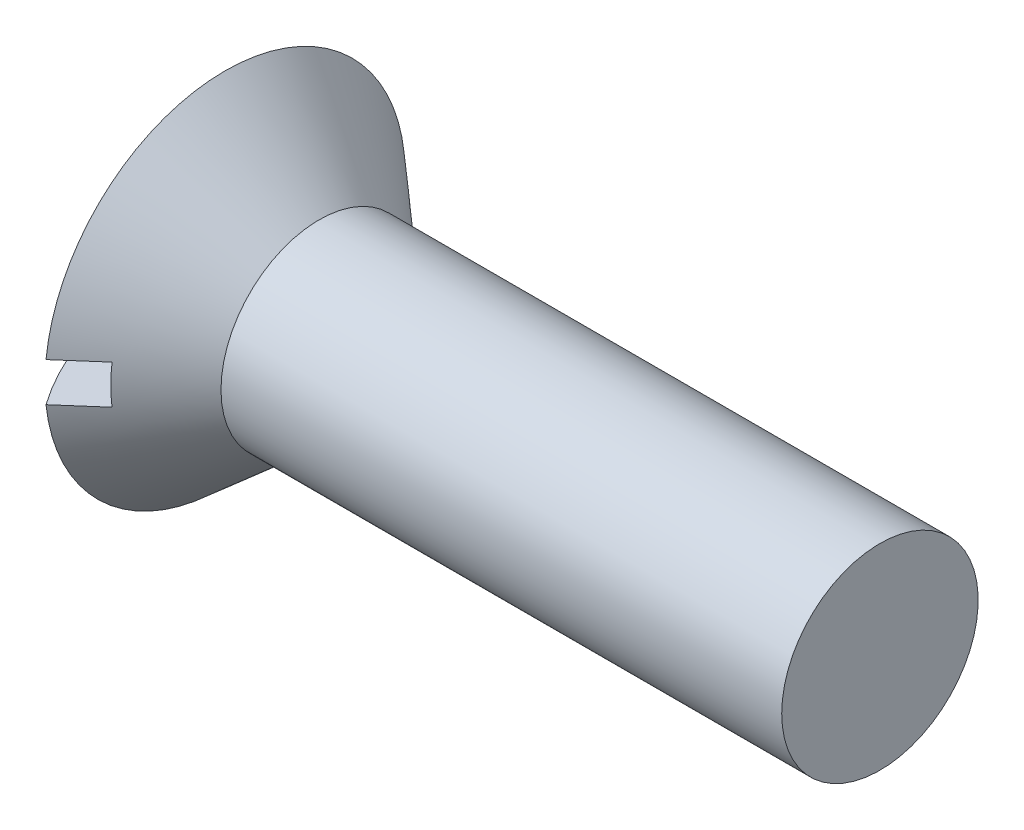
ISO-10303-21;
HEADER;
FILE_DESCRIPTION(('STEP AP214'),'2;1');
FILE_NAME('part.step','',(''),(''),'','','');
FILE_SCHEMA(('AUTOMOTIVE_DESIGN { 1 0 10303 214 1 1 1 1 }'));
ENDSEC;
DATA;
#1=APPLICATION_CONTEXT('core data for automotive mechanical design processes');
#2=APPLICATION_PROTOCOL_DEFINITION('international standard','automotive_design',2000,#1);
#3=PRODUCT_CONTEXT('',#1,'mechanical');
#4=PRODUCT('Part','Part','',(#3));
#5=PRODUCT_RELATED_PRODUCT_CATEGORY('part','',(#4));
#6=PRODUCT_DEFINITION_FORMATION('','',#4);
#7=PRODUCT_DEFINITION_CONTEXT('part definition',#1,'design');
#8=PRODUCT_DEFINITION('design','',#6,#7);
#9=PRODUCT_DEFINITION_SHAPE('','',#8);
#10=(LENGTH_UNIT() NAMED_UNIT(*) SI_UNIT(.MILLI.,.METRE.));
#11=(NAMED_UNIT(*) PLANE_ANGLE_UNIT() SI_UNIT($,.RADIAN.));
#12=(NAMED_UNIT(*) SI_UNIT($,.STERADIAN.) SOLID_ANGLE_UNIT());
#13=UNCERTAINTY_MEASURE_WITH_UNIT(LENGTH_MEASURE(1.E-05),#10,'distance_accuracy_value','');
#14=(GEOMETRIC_REPRESENTATION_CONTEXT(3) GLOBAL_UNCERTAINTY_ASSIGNED_CONTEXT((#13)) GLOBAL_UNIT_ASSIGNED_CONTEXT((#10,
#11,#12)) REPRESENTATION_CONTEXT('',''));
#15=CARTESIAN_POINT('',(0.,0.,0.));
#16=DIRECTION('',(0.,0.,1.));
#17=DIRECTION('',(1.,0.,0.));
#18=AXIS2_PLACEMENT_3D('',#15,#16,#17);
#19=CARTESIAN_POINT('',(8.9662,1.8923,-17.4625));
#20=DIRECTION('',(-1.,0.,0.));
#21=DIRECTION('',(0.,0.,1.));
#22=AXIS2_PLACEMENT_3D('',#19,#20,#21);
#23=PLANE('',#22);
#24=DIRECTION('',(0.,0.,1.));
#25=VECTOR('',#24,1.);
#26=CARTESIAN_POINT('',(8.9662,-1.8923,-17.4625));
#27=LINE('',#26,#25);
#28=CARTESIAN_POINT('',(8.9662,-1.8923,-14.3689069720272));
#29=VERTEX_POINT('',#28);
#30=CARTESIAN_POINT('',(8.9662,-1.8923,14.3689069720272));
#31=VERTEX_POINT('',#30);
#32=EDGE_CURVE('E244',#29,#31,#27,.T.);
#33=ORIENTED_EDGE('',*,*,#32,.T.);
#34=CARTESIAN_POINT('',(8.9662,0.,0.));
#35=DIRECTION('',(-1.,0.,0.));
#36=DIRECTION('',(0.,0.,1.));
#37=AXIS2_PLACEMENT_3D('',#34,#35,#36);
#38=CIRCLE('',#37,14.4929737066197);
#39=CARTESIAN_POINT('',(8.9662,1.8923,14.3689069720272));
#40=VERTEX_POINT('',#39);
#41=EDGE_CURVE('E264',#40,#31,#38,.F.);
#42=ORIENTED_EDGE('',*,*,#41,.F.);
#43=DIRECTION('',(0.,0.,-1.));
#44=VECTOR('',#43,1.);
#45=CARTESIAN_POINT('',(8.9662,1.8923,17.4625));
#46=LINE('',#45,#44);
#47=CARTESIAN_POINT('',(8.9662,1.8923,-14.3689069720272));
#48=VERTEX_POINT('',#47);
#49=EDGE_CURVE('E241',#40,#48,#46,.T.);
#50=ORIENTED_EDGE('',*,*,#49,.T.);
#51=EDGE_CURVE('E268',#29,#48,#38,.F.);
#52=ORIENTED_EDGE('',*,*,#51,.F.);
#53=EDGE_LOOP('',(#33,#42,#50,#52));
#54=FACE_BOUND('',#53,.T.);
#55=DIRECTION('',(0.,-1.,0.));
#56=VECTOR('',#55,1.);
#57=CARTESIAN_POINT('',(8.9662,1.8923,0.737997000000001));
#58=LINE('',#57,#56);
#59=CARTESIAN_POINT('',(8.9662,1.561719,0.737997));
#60=VERTEX_POINT('',#59);
#61=CARTESIAN_POINT('',(8.9662,0.737996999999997,0.737997));
#62=VERTEX_POINT('',#61);
#63=EDGE_CURVE('E183',#60,#62,#58,.T.);
#64=ORIENTED_EDGE('',*,*,#63,.T.);
#65=DIRECTION('',(0.,0.,1.));
#66=VECTOR('',#65,1.);
#67=CARTESIAN_POINT('',(8.9662,0.737997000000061,-17.4625));
#68=LINE('',#67,#66);
#69=CARTESIAN_POINT('',(8.9662,0.737996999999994,1.561719));
#70=VERTEX_POINT('',#69);
#71=EDGE_CURVE('E163',#62,#70,#68,.T.);
#72=ORIENTED_EDGE('',*,*,#71,.T.);
#73=DIRECTION('',(0.,1.,0.));
#74=VECTOR('',#73,1.);
#75=CARTESIAN_POINT('',(8.9662,1.89229999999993,1.56171900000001));
#76=LINE('',#75,#74);
#77=CARTESIAN_POINT('',(8.9662,-0.737997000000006,1.561719));
#78=VERTEX_POINT('',#77);
#79=EDGE_CURVE('E176',#78,#70,#76,.T.);
#80=ORIENTED_EDGE('',*,*,#79,.F.);
#81=DIRECTION('',(0.,0.,-1.));
#82=VECTOR('',#81,1.);
#83=CARTESIAN_POINT('',(8.9662,-0.737996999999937,-17.4625));
#84=LINE('',#83,#82);
#85=CARTESIAN_POINT('',(8.9662,-0.737997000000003,0.737997));
#86=VERTEX_POINT('',#85);
#87=EDGE_CURVE('E206',#78,#86,#84,.T.);
#88=ORIENTED_EDGE('',*,*,#87,.T.);
#89=CARTESIAN_POINT('',(8.9662,-1.561719,0.737997));
#90=VERTEX_POINT('',#89);
#91=EDGE_CURVE('E319',#86,#90,#58,.T.);
#92=ORIENTED_EDGE('',*,*,#91,.T.);
#93=DIRECTION('',(0.,0.,1.));
#94=VECTOR('',#93,1.);
#95=CARTESIAN_POINT('',(8.9662,-1.561719,-17.4625));
#96=LINE('',#95,#94);
#97=CARTESIAN_POINT('',(8.9662,-1.561719,-0.737997));
#98=VERTEX_POINT('',#97);
#99=EDGE_CURVE('E323',#98,#90,#96,.T.);
#100=ORIENTED_EDGE('',*,*,#99,.F.);
#101=DIRECTION('',(0.,1.,0.));
#102=VECTOR('',#101,1.);
#103=CARTESIAN_POINT('',(8.9662,1.8923,-0.737996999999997));
#104=LINE('',#103,#102);
#105=CARTESIAN_POINT('',(8.9662,-0.737996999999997,-0.737997));
#106=VERTEX_POINT('',#105);
#107=EDGE_CURVE('E321',#98,#106,#104,.T.);
#108=ORIENTED_EDGE('',*,*,#107,.T.);
#109=CARTESIAN_POINT('',(8.9662,-0.737996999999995,-1.561719));
#110=VERTEX_POINT('',#109);
#111=EDGE_CURVE('E350',#106,#110,#84,.T.);
#112=ORIENTED_EDGE('',*,*,#111,.T.);
#113=DIRECTION('',(0.,-1.,0.));
#114=VECTOR('',#113,1.);
#115=CARTESIAN_POINT('',(8.9662,1.89229999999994,-1.561719));
#116=LINE('',#115,#114);
#117=CARTESIAN_POINT('',(8.9662,0.737997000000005,-1.561719));
#118=VERTEX_POINT('',#117);
#119=EDGE_CURVE('E177',#118,#110,#116,.T.);
#120=ORIENTED_EDGE('',*,*,#119,.F.);
#121=CARTESIAN_POINT('',(8.9662,0.737997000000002,-0.737997));
#122=VERTEX_POINT('',#121);
#123=EDGE_CURVE('E167',#118,#122,#68,.T.);
#124=ORIENTED_EDGE('',*,*,#123,.T.);
#125=CARTESIAN_POINT('',(8.9662,1.561719,-0.737996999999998));
#126=VERTEX_POINT('',#125);
#127=EDGE_CURVE('E318',#122,#126,#104,.T.);
#128=ORIENTED_EDGE('',*,*,#127,.T.);
#129=DIRECTION('',(0.,0.,-1.));
#130=VECTOR('',#129,1.);
#131=CARTESIAN_POINT('',(8.9662,1.561719,-17.4625));
#132=LINE('',#131,#130);
#133=EDGE_CURVE('E41',#60,#126,#132,.T.);
#134=ORIENTED_EDGE('',*,*,#133,.F.);
#135=EDGE_LOOP('',(#64,#72,#80,#88,#92,#100,#108,#112,#120,#124,#128,#134));
#136=FACE_BOUND('',#135,.T.);
#137=ADVANCED_FACE('F33',(#54,#136),#23,.T.);
#138=CARTESIAN_POINT('',(11.034701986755,0.,0.603544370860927));
#139=DIRECTION('',(-0.06486312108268,0.,-0.997894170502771));
#140=DIRECTION('',(-0.997894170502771,0.,0.06486312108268));
#141=AXIS2_PLACEMENT_3D('',#138,#139,#140);
#142=PLANE('',#141);
#143=DIRECTION('',(0.797008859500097,-0.601741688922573,-0.0518055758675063));
#144=VECTOR('',#143,1.);
#145=CARTESIAN_POINT('',(0.,8.3312,1.3208));
#146=LINE('',#145,#144);
#147=CARTESIAN_POINT('',(10.16,0.660399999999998,0.660400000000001));
#148=VERTEX_POINT('',#147);
#149=EDGE_CURVE('E181',#60,#148,#146,.T.);
#150=ORIENTED_EDGE('',*,*,#149,.T.);
#151=DIRECTION('',(-0.995801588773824,0.0647271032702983,0.0647271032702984));
#152=VECTOR('',#151,1.);
#153=CARTESIAN_POINT('',(11.0736036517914,0.601015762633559,0.601015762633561));
#154=LINE('',#153,#152);
#155=EDGE_CURVE('E158',#148,#62,#154,.T.);
#156=ORIENTED_EDGE('',*,*,#155,.T.);
#157=ORIENTED_EDGE('',*,*,#63,.F.);
#158=EDGE_LOOP('',(#150,#156,#157));
#159=FACE_BOUND('',#158,.T.);
#160=ADVANCED_FACE('F182',(#159),#142,.T.);
#161=ORIENTED_EDGE('',*,*,#91,.F.);
#162=DIRECTION('',(0.995801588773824,0.0647271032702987,-0.0647271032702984));
#163=VECTOR('',#162,1.);
#164=CARTESIAN_POINT('',(11.0736036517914,-0.601015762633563,0.601015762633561));
#165=LINE('',#164,#163);
#166=CARTESIAN_POINT('',(10.16,-0.6604,0.6604));
#167=VERTEX_POINT('',#166);
#168=EDGE_CURVE('E333',#86,#167,#165,.T.);
#169=ORIENTED_EDGE('',*,*,#168,.T.);
#170=DIRECTION('',(0.797008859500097,0.601741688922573,-0.0518055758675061));
#171=VECTOR('',#170,1.);
#172=CARTESIAN_POINT('',(0.,-8.3312,1.3208));
#173=LINE('',#172,#171);
#174=EDGE_CURVE('E339',#90,#167,#173,.T.);
#175=ORIENTED_EDGE('',*,*,#174,.F.);
#176=EDGE_LOOP('',(#161,#169,#175));
#177=FACE_BOUND('',#176,.T.);
#178=ADVANCED_FACE('F313',(#177),#142,.T.);
#179=CARTESIAN_POINT('',(11.034701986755,0.,-0.603544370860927));
#180=DIRECTION('',(-0.0648631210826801,0.,0.997894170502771));
#181=DIRECTION('',(0.997894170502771,0.,0.0648631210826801));
#182=AXIS2_PLACEMENT_3D('',#179,#180,#181);
#183=PLANE('',#182);
#184=ORIENTED_EDGE('',*,*,#127,.F.);
#185=DIRECTION('',(0.995801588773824,-0.0647271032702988,0.0647271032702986));
#186=VECTOR('',#185,1.);
#187=CARTESIAN_POINT('',(11.0736036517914,0.601015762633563,-0.601015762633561));
#188=LINE('',#187,#186);
#189=CARTESIAN_POINT('',(10.16,0.660400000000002,-0.660399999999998));
#190=VERTEX_POINT('',#189);
#191=EDGE_CURVE('E329',#122,#190,#188,.T.);
#192=ORIENTED_EDGE('',*,*,#191,.T.);
#193=DIRECTION('',(0.797008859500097,-0.601741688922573,0.0518055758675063));
#194=VECTOR('',#193,1.);
#195=CARTESIAN_POINT('',(0.,8.3312,-1.3208));
#196=LINE('',#195,#194);
#197=EDGE_CURVE('E202',#126,#190,#196,.T.);
#198=ORIENTED_EDGE('',*,*,#197,.F.);
#199=EDGE_LOOP('',(#184,#192,#198));
#200=FACE_BOUND('',#199,.T.);
#201=ADVANCED_FACE('F328',(#200),#183,.T.);
#202=DIRECTION('',(0.797008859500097,0.601741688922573,0.0518055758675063));
#203=VECTOR('',#202,1.);
#204=CARTESIAN_POINT('',(0.,-8.3312,-1.3208));
#205=LINE('',#204,#203);
#206=CARTESIAN_POINT('',(10.16,-0.6604,-0.6604));
#207=VERTEX_POINT('',#206);
#208=EDGE_CURVE('E336',#98,#207,#205,.T.);
#209=ORIENTED_EDGE('',*,*,#208,.T.);
#210=DIRECTION('',(-0.995801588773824,-0.0647271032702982,-0.0647271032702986));
#211=VECTOR('',#210,1.);
#212=CARTESIAN_POINT('',(11.0736036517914,-0.601015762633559,-0.601015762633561));
#213=LINE('',#212,#211);
#214=EDGE_CURVE('E11',#207,#106,#213,.T.);
#215=ORIENTED_EDGE('',*,*,#214,.T.);
#216=ORIENTED_EDGE('',*,*,#107,.F.);
#217=EDGE_LOOP('',(#209,#215,#216));
#218=FACE_BOUND('',#217,.T.);
#219=ADVANCED_FACE('F396',(#218),#183,.T.);
#220=CARTESIAN_POINT('',(30.2463026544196,0.,0.));
#221=DIRECTION('',(-1.,0.,0.));
#222=DIRECTION('',(0.,1.,0.));
#223=AXIS2_PLACEMENT_3D('',#220,#221,#222);
#224=SPHERICAL_SURFACE('',#223,30.2463026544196);
#225=CARTESIAN_POINT('',(30.2463026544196,1.8923,0.));
#226=DIRECTION('',(0.,1.,0.));
#227=DIRECTION('',(0.,0.,1.));
#228=AXIS2_PLACEMENT_3D('',#225,#226,#227);
#229=CIRCLE('',#228,30.1870506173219);
#230=CARTESIAN_POINT('',(0.0879112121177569,1.8923,-1.31508577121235));
#231=VERTEX_POINT('',#230);
#232=CARTESIAN_POINT('',(5.55015076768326,1.8923,-17.3596689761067));
#233=VERTEX_POINT('',#232);
#234=EDGE_CURVE('E250',#231,#233,#229,.F.);
#235=ORIENTED_EDGE('',*,*,#234,.F.);
#236=CARTESIAN_POINT('',(30.20454047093,0.,0.642495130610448));
#237=DIRECTION('',(-0.0648631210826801,0.,0.997894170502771));
#238=DIRECTION('',(0.997894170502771,0.,0.0648631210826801));
#239=AXIS2_PLACEMENT_3D('',#236,#237,#238);
#240=CIRCLE('',#239,30.2394490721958);
#241=CARTESIAN_POINT('',(0.992628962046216,7.58176513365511,-1.256279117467));
#242=VERTEX_POINT('',#241);
#243=EDGE_CURVE('E233',#231,#242,#240,.F.);
#244=ORIENTED_EDGE('',*,*,#243,.T.);
#245=CARTESIAN_POINT('',(23.2711954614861,-9.23855257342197,0.));
#246=DIRECTION('',(0.602550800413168,0.798080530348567,0.));
#247=DIRECTION('',(-0.798080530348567,0.602550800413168,0.));
#248=AXIS2_PLACEMENT_3D('',#245,#246,#247);
#249=CIRCLE('',#248,27.9434402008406);
#250=CARTESIAN_POINT('',(0.992628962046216,7.58176513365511,1.256279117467));
#251=VERTEX_POINT('',#250);
#252=EDGE_CURVE('E239',#251,#242,#249,.F.);
#253=ORIENTED_EDGE('',*,*,#252,.F.);
#254=CARTESIAN_POINT('',(30.20454047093,0.,-0.642495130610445));
#255=DIRECTION('',(-0.06486312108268,0.,-0.997894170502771));
#256=DIRECTION('',(-0.997894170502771,0.,0.06486312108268));
#257=AXIS2_PLACEMENT_3D('',#254,#255,#256);
#258=CIRCLE('',#257,30.2394490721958);
#259=CARTESIAN_POINT('',(0.0879112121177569,1.8923,1.31508577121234));
#260=VERTEX_POINT('',#259);
#261=EDGE_CURVE('E223',#251,#260,#258,.F.);
#262=ORIENTED_EDGE('',*,*,#261,.T.);
#263=CARTESIAN_POINT('',(5.55015076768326,1.8923,17.3596689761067));
#264=VERTEX_POINT('',#263);
#265=EDGE_CURVE('E251',#264,#260,#229,.F.);
#266=ORIENTED_EDGE('',*,*,#265,.F.);
#267=CARTESIAN_POINT('',(5.55015076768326,0.,0.));
#268=DIRECTION('',(-1.,0.,0.));
#269=DIRECTION('',(0.,0.,1.));
#270=AXIS2_PLACEMENT_3D('',#267,#268,#269);
#271=CIRCLE('',#270,17.4625);
#272=EDGE_CURVE('E263',#264,#233,#271,.T.);
#273=ORIENTED_EDGE('',*,*,#272,.T.);
#274=EDGE_LOOP('',(#235,#244,#253,#262,#266,#273));
#275=FACE_BOUND('',#274,.T.);
#276=ADVANCED_FACE('F387',(#275),#224,.T.);
#277=CARTESIAN_POINT('',(23.2711954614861,9.23855257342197,0.));
#278=DIRECTION('',(0.602550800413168,-0.798080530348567,0.));
#279=DIRECTION('',(0.798080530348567,0.602550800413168,0.));
#280=AXIS2_PLACEMENT_3D('',#277,#278,#279);
#281=CIRCLE('',#280,27.9434402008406);
#282=CARTESIAN_POINT('',(0.992628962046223,-7.58176513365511,-1.256279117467));
#283=VERTEX_POINT('',#282);
#284=CARTESIAN_POINT('',(0.992628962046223,-7.58176513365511,1.25627911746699));
#285=VERTEX_POINT('',#284);
#286=EDGE_CURVE('E213',#283,#285,#281,.F.);
#287=ORIENTED_EDGE('',*,*,#286,.F.);
#288=CARTESIAN_POINT('',(30.20454047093,0.,0.642495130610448));
#289=DIRECTION('',(-0.0648631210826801,0.,0.997894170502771));
#290=DIRECTION('',(0.997894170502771,0.,0.0648631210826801));
#291=AXIS2_PLACEMENT_3D('',#288,#289,#290);
#292=CIRCLE('',#291,30.2394490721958);
#293=CARTESIAN_POINT('',(0.0879112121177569,-1.8923,-1.31508577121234));
#294=VERTEX_POINT('',#293);
#295=EDGE_CURVE('E228',#283,#294,#292,.F.);
#296=ORIENTED_EDGE('',*,*,#295,.T.);
#297=CARTESIAN_POINT('',(30.2463026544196,-1.8923,0.));
#298=DIRECTION('',(0.,-1.,0.));
#299=DIRECTION('',(0.,0.,-1.));
#300=AXIS2_PLACEMENT_3D('',#297,#298,#299);
#301=CIRCLE('',#300,30.1870506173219);
#302=CARTESIAN_POINT('',(5.55015076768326,-1.8923,-17.3596689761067));
#303=VERTEX_POINT('',#302);
#304=EDGE_CURVE('E247',#303,#294,#301,.F.);
#305=ORIENTED_EDGE('',*,*,#304,.F.);
#306=CARTESIAN_POINT('',(5.55015076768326,-1.8923,17.3596689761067));
#307=VERTEX_POINT('',#306);
#308=EDGE_CURVE('E260',#303,#307,#271,.T.);
#309=ORIENTED_EDGE('',*,*,#308,.T.);
#310=CARTESIAN_POINT('',(0.0879112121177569,-1.8923,1.31508577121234));
#311=VERTEX_POINT('',#310);
#312=EDGE_CURVE('E246',#311,#307,#301,.F.);
#313=ORIENTED_EDGE('',*,*,#312,.F.);
#314=CARTESIAN_POINT('',(30.20454047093,0.,-0.642495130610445));
#315=DIRECTION('',(-0.06486312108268,0.,-0.997894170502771));
#316=DIRECTION('',(-0.997894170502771,0.,0.06486312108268));
#317=AXIS2_PLACEMENT_3D('',#314,#315,#316);
#318=CIRCLE('',#317,30.2394490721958);
#319=EDGE_CURVE('E218',#311,#285,#318,.F.);
#320=ORIENTED_EDGE('',*,*,#319,.T.);
#321=EDGE_LOOP('',(#287,#296,#305,#309,#313,#320));
#322=FACE_BOUND('',#321,.T.);
#323=ADVANCED_FACE('F295',(#322),#224,.T.);
#324=CARTESIAN_POINT('',(8.9662,1.8923,17.4625));
#325=DIRECTION('',(0.,1.,0.));
#326=DIRECTION('',(0.,0.,1.));
#327=AXIS2_PLACEMENT_3D('',#324,#325,#326);
#328=PLANE('',#327);
#329=DIRECTION('',(0.997894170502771,0.,0.0648631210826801));
#330=VECTOR('',#329,1.);
#331=CARTESIAN_POINT('',(10.1442550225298,1.8923,-0.661423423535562));
#332=LINE('',#331,#330);
#333=CARTESIAN_POINT('',(8.52834437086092,1.8923,-0.76645761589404));
#334=VERTEX_POINT('',#333);
#335=EDGE_CURVE('E231',#231,#334,#332,.T.);
#336=ORIENTED_EDGE('',*,*,#335,.F.);
#337=ORIENTED_EDGE('',*,*,#234,.T.);
#338=CARTESIAN_POINT('',(-15.5050487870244,1.8923,-35.715411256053));
#339=CARTESIAN_POINT('',(-14.1406938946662,1.8923,-34.5277204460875));
#340=CARTESIAN_POINT('',(-12.7764101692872,1.8923,-33.3399478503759));
#341=CARTESIAN_POINT('',(-10.0480662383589,1.8923,-30.9641371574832));
#342=CARTESIAN_POINT('',(-8.6840060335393,1.8923,-29.7760990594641));
#343=CARTESIAN_POINT('',(-5.95598275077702,1.8923,-27.3994745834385));
#344=CARTESIAN_POINT('',(-4.5920197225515,1.8923,-26.2108881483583));
#345=CARTESIAN_POINT('',(-1.86456729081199,1.8923,-23.8331804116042));
#346=CARTESIAN_POINT('',(-0.501077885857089,1.8923,-22.6440591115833));
#347=CARTESIAN_POINT('',(2.21114624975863,1.8923,-20.2772147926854));
#348=CARTESIAN_POINT('',(3.55988847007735,1.8923,-19.0995003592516));
#349=CARTESIAN_POINT('',(5.58207778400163,1.8923,-17.3318587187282));
#350=CARTESIAN_POINT('',(6.25599005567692,1.8923,-16.742463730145));
#351=CARTESIAN_POINT('',(7.60338463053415,1.8923,-15.5631834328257));
#352=CARTESIAN_POINT('',(8.27686693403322,1.8923,-14.9732981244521));
#353=CARTESIAN_POINT('',(9.62314657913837,1.8923,-13.7929118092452));
#354=CARTESIAN_POINT('',(10.2959439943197,1.8923,-13.2024108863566));
#355=CARTESIAN_POINT('',(11.6406484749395,1.8923,-12.0203920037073));
#356=CARTESIAN_POINT('',(12.3125555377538,1.8923,-11.4288740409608));
#357=CARTESIAN_POINT('',(13.6549790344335,1.8923,-10.2442823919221));
#358=CARTESIAN_POINT('',(14.3254954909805,1.8923,-9.65120873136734));
#359=CARTESIAN_POINT('',(15.329486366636,1.8923,-8.75959235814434));
#360=CARTESIAN_POINT('',(15.6638518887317,1.8923,-8.46205330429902));
#361=CARTESIAN_POINT('',(16.3317648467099,1.8923,-7.86605866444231));
#362=CARTESIAN_POINT('',(16.6653122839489,1.8923,-7.5676030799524));
#363=CARTESIAN_POINT('',(17.1729591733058,1.8923,-7.11159936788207));
#364=CARTESIAN_POINT('',(17.3474765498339,1.8923,-6.95451652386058));
#365=CARTESIAN_POINT('',(17.6961222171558,1.8923,-6.63991888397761));
#366=CARTESIAN_POINT('',(17.8702505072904,1.8923,-6.48240408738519));
#367=CARTESIAN_POINT('',(18.2180548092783,1.8923,-6.16681999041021));
#368=CARTESIAN_POINT('',(18.3917307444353,1.8923,-6.00875060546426));
#369=CARTESIAN_POINT('',(18.7384791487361,1.8923,-5.69195182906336));
#370=CARTESIAN_POINT('',(18.911551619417,1.8923,-5.53322243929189));
#371=CARTESIAN_POINT('',(19.2574412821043,1.8923,-5.21445042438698));
#372=CARTESIAN_POINT('',(19.4302561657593,1.8923,-5.05440529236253));
#373=CARTESIAN_POINT('',(19.7748686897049,1.8923,-4.73322398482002));
#374=CARTESIAN_POINT('',(19.9466663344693,1.8923,-4.57208781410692));
#375=CARTESIAN_POINT('',(20.2888297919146,1.8923,-4.24842870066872));
#376=CARTESIAN_POINT('',(20.4591961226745,1.8923,-4.08590630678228));
#377=CARTESIAN_POINT('',(20.7980187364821,1.8923,-3.75888936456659));
#378=CARTESIAN_POINT('',(20.966475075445,1.8923,-3.59439487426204));
#379=CARTESIAN_POINT('',(21.3001804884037,1.8923,-3.26307453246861));
#380=CARTESIAN_POINT('',(21.4654370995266,1.8923,-3.09625632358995));
#381=CARTESIAN_POINT('',(21.7102247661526,1.8923,-2.84286427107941));
#382=CARTESIAN_POINT('',(21.7913457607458,1.8923,-2.75782782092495));
#383=CARTESIAN_POINT('',(21.9522191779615,1.8923,-2.58647210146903));
#384=CARTESIAN_POINT('',(22.0319716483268,1.8923,-2.50015287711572));
#385=CARTESIAN_POINT('',(22.1896478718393,1.8923,-2.32596801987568));
#386=CARTESIAN_POINT('',(22.2675729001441,1.8923,-2.23810354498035));
#387=CARTESIAN_POINT('',(22.4210573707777,1.8923,-2.06033879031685));
#388=CARTESIAN_POINT('',(22.4966170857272,1.8923,-1.97043874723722));
#389=CARTESIAN_POINT('',(22.6443921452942,1.8923,-1.78813953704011));
#390=CARTESIAN_POINT('',(22.716612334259,1.8923,-1.6957443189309));
#391=CARTESIAN_POINT('',(22.8564713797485,1.8923,-1.50756971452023));
#392=CARTESIAN_POINT('',(22.9241125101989,1.8923,-1.41179204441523));
#393=CARTESIAN_POINT('',(23.0326352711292,1.8923,-1.24636364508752));
#394=CARTESIAN_POINT('',(23.0752840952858,1.8923,-1.17787883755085));
#395=CARTESIAN_POINT('',(23.1563723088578,1.8923,-1.03839313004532));
#396=CARTESIAN_POINT('',(23.1948100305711,1.8923,-0.96739124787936));
#397=CARTESIAN_POINT('',(23.265817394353,1.8923,-0.823020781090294));
#398=CARTESIAN_POINT('',(23.2984219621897,1.8923,-0.749669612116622));
#399=CARTESIAN_POINT('',(23.3562088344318,1.8923,-0.600098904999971));
#400=CARTESIAN_POINT('',(23.3813986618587,1.8923,-0.523882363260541));
#401=CARTESIAN_POINT('',(23.4146011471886,1.8923,-0.398188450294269));
#402=CARTESIAN_POINT('',(23.4255088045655,1.8923,-0.349472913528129));
#403=CARTESIAN_POINT('',(23.4432112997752,1.8923,-0.251306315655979));
#404=CARTESIAN_POINT('',(23.4500077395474,1.8923,-0.201855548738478));
#405=CARTESIAN_POINT('',(23.4591640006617,1.8923,-0.102571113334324));
#406=CARTESIAN_POINT('',(23.4615265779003,1.8923,-0.0527377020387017));
#407=CARTESIAN_POINT('',(23.4617021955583,1.8923,0.0469391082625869));
#408=CARTESIAN_POINT('',(23.4595150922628,1.8923,0.0967825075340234));
#409=CARTESIAN_POINT('',(23.4507174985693,1.8923,0.195918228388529));
#410=CARTESIAN_POINT('',(23.4441205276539,1.8923,0.245211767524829));
#411=CARTESIAN_POINT('',(23.4268294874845,1.8923,0.343076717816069));
#412=CARTESIAN_POINT('',(23.4161344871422,1.8923,0.391647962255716));
#413=CARTESIAN_POINT('',(23.3910724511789,1.8923,0.487901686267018));
#414=CARTESIAN_POINT('',(23.3766998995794,1.8923,0.535582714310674));
#415=CARTESIAN_POINT('',(23.3447813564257,1.8923,0.629857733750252));
#416=CARTESIAN_POINT('',(23.3272353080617,1.8923,0.676451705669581));
#417=CARTESIAN_POINT('',(23.2621196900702,1.8923,0.835171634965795));
#418=CARTESIAN_POINT('',(23.2078474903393,1.8923,0.944552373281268));
#419=CARTESIAN_POINT('',(23.0888989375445,1.8923,1.15753031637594));
#420=CARTESIAN_POINT('',(23.0242010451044,1.8923,1.26111493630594));
#421=CARTESIAN_POINT('',(22.8874797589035,1.8923,1.46451215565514));
#422=CARTESIAN_POINT('',(22.8154009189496,1.8923,1.56428709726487));
#423=CARTESIAN_POINT('',(22.7038424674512,1.8923,1.71121549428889));
#424=CARTESIAN_POINT('',(22.6661011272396,1.8923,1.75971424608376));
#425=CARTESIAN_POINT('',(22.5896404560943,1.8923,1.85593349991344));
#426=CARTESIAN_POINT('',(22.5509211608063,1.8923,1.90365403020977));
#427=CARTESIAN_POINT('',(22.4259654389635,1.8923,2.05498191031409));
#428=CARTESIAN_POINT('',(22.3381770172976,1.8923,2.15730689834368));
#429=CARTESIAN_POINT('',(22.1598499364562,1.8923,2.35953904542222));
#430=CARTESIAN_POINT('',(22.0693108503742,1.8923,2.45944582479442));
#431=CARTESIAN_POINT('',(21.8861840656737,1.8923,2.65744732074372));
#432=CARTESIAN_POINT('',(21.7935954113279,1.8923,2.75554115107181));
#433=CARTESIAN_POINT('',(21.6069036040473,1.8923,2.95027925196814));
#434=CARTESIAN_POINT('',(21.5128003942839,1.8923,3.04692346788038));
#435=CARTESIAN_POINT('',(21.2284203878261,1.8923,3.33549678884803));
#436=CARTESIAN_POINT('',(21.0364062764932,1.8923,3.52571194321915));
#437=CARTESIAN_POINT('',(20.649545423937,1.8923,3.90310850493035));
#438=CARTESIAN_POINT('',(20.4546995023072,1.8923,4.09029075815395));
#439=CARTESIAN_POINT('',(20.0636531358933,1.8923,4.46201377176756));
#440=CARTESIAN_POINT('',(19.8674587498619,1.8923,4.6465609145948));
#441=CARTESIAN_POINT('',(19.4736812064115,1.8923,5.01419280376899));
#442=CARTESIAN_POINT('',(19.2760979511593,1.8923,5.19727744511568));
#443=CARTESIAN_POINT('',(18.8801396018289,1.8923,5.56215012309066));
#444=CARTESIAN_POINT('',(18.6817656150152,1.8923,5.74393936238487));
#445=CARTESIAN_POINT('',(18.2842596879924,1.8923,6.1066768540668));
#446=CARTESIAN_POINT('',(18.085127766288,1.8923,6.28762512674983));
#447=CARTESIAN_POINT('',(17.4887094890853,1.8923,6.8278242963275));
#448=CARTESIAN_POINT('',(17.0905582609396,1.8923,7.18612000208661));
#449=CARTESIAN_POINT('',(16.2927935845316,1.8923,7.90108069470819));
#450=CARTESIAN_POINT('',(15.8931801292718,1.8923,8.25774567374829));
#451=CARTESIAN_POINT('',(15.0929489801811,1.8923,8.96996376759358));
#452=CARTESIAN_POINT('',(14.6923312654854,1.8923,9.32551685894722));
#453=CARTESIAN_POINT('',(13.8903884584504,1.8923,10.0358246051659));
#454=CARTESIAN_POINT('',(13.4890633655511,1.8923,10.3905792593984));
#455=CARTESIAN_POINT('',(12.2839668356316,1.8923,11.4542863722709));
#456=CARTESIAN_POINT('',(11.4794272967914,1.8923,12.1623684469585));
#457=CARTESIAN_POINT('',(9.86917220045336,1.8923,13.5771764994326));
#458=CARTESIAN_POINT('',(9.06345665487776,1.8923,14.2839024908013));
#459=CARTESIAN_POINT('',(7.45128183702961,1.8923,15.6964671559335));
#460=CARTESIAN_POINT('',(6.64482258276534,1.8923,16.4023058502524));
#461=CARTESIAN_POINT('',(5.03138583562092,1.8923,17.8133948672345));
#462=CARTESIAN_POINT('',(4.22440834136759,1.8923,18.5186451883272));
#463=CARTESIAN_POINT('',(1.80314585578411,1.8923,20.6335994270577));
#464=CARTESIAN_POINT('',(0.188323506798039,1.8923,22.0426881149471));
#465=CARTESIAN_POINT('',(-2.59955329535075,1.8923,24.4740157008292));
#466=CARTESIAN_POINT('',(-3.77242263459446,1.8923,25.496466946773));
#467=CARTESIAN_POINT('',(-6.11850104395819,1.8923,27.5410693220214));
#468=CARTESIAN_POINT('',(-7.29171012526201,1.8923,28.5632204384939));
#469=CARTESIAN_POINT('',(-9.63820701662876,1.8923,30.607166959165));
#470=CARTESIAN_POINT('',(-10.8114948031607,1.8923,31.6289623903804));
#471=CARTESIAN_POINT('',(-13.1581861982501,1.8923,33.6723301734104));
#472=CARTESIAN_POINT('',(-14.3315898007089,1.8923,34.6939025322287));
#473=CARTESIAN_POINT('',(-15.5050487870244,1.8923,35.715411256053));
#474=B_SPLINE_CURVE_WITH_KNOTS('',3,(#338,#339,#340,#341,#342,#343,#344,#345,#346,#347,#348,
#349,#350,#351,#352,#353,#354,#355,#356,#357,#358,#359,#360,#361,#362,#363,#364,#365,#366,#367,
#368,#369,#370,#371,#372,#373,#374,#375,#376,#377,#378,#379,#380,#381,#382,#383,#384,#385,#386,
#387,#388,#389,#390,#391,#392,#393,#394,#395,#396,#397,#398,#399,#400,#401,#402,#403,#404,#405,
#406,#407,#408,#409,#410,#411,#412,#413,#414,#415,#416,#417,#418,#419,#420,#421,#422,#423,#424,
#425,#426,#427,#428,#429,#430,#431,#432,#433,#434,#435,#436,#437,#438,#439,#440,#441,#442,#443,
#444,#445,#446,#447,#448,#449,#450,#451,#452,#453,#454,#455,#456,#457,#458,#459,#460,#461,#462,
#463,#464,#465,#466,#467,#468,#469,#470,#471,#472,#473),.UNSPECIFIED.,.F.,.F.,(4,2,2,2,2,2,2,2,
2,2,2,2,2,2,2,2,2,2,2,2,2,2,2,2,2,2,2,2,2,2,2,2,2,2,2,2,2,2,2,2,2,2,2,2,2,2,2,2,2,2,2,2,2,2,2,2,
2,2,2,2,2,2,2,2,2,2,2,4),(0.,5.42666231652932,10.8533420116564,16.2808823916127,
21.7084061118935,27.0800952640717,29.7659651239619,32.4518330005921,35.1373730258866,
37.8229209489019,40.5084247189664,41.8511701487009,43.1939133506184,43.8983146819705,
44.6027172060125,45.3072322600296,46.0117455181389,46.718364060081,47.4249794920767,
48.1313270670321,48.8376539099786,49.5420411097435,49.8946010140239,50.2471485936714,
50.599442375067,50.9516954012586,51.3034202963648,51.6549692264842,51.8968961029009,
52.138918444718,52.3794392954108,52.6197152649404,52.7693296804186,52.9188857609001,
53.0683488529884,53.2178166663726,53.3668283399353,53.5158738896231,53.665144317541,
53.8144174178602,54.1797126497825,54.5457724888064,54.9148180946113,55.0991711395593,
55.2835174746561,55.6879070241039,56.0923596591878,56.4970050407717,56.9016656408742,
57.7124459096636,58.5229960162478,59.3310374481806,60.1391363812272,60.946348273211,
61.7535405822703,63.3604242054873,64.9673155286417,66.5742405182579,68.1811667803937,
71.3964360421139,74.6116729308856,77.8268339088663,81.0420034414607,87.4715158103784,
92.1394126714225,96.8074863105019,101.475037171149,106.142410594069),.UNSPECIFIED.);
#475=EDGE_CURVE('E365',#233,#48,#474,.T.);
#476=ORIENTED_EDGE('',*,*,#475,.T.);
#477=ORIENTED_EDGE('',*,*,#49,.F.);
#478=EDGE_CURVE('E276',#40,#264,#474,.T.);
#479=ORIENTED_EDGE('',*,*,#478,.T.);
#480=ORIENTED_EDGE('',*,*,#265,.T.);
#481=DIRECTION('',(-0.997894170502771,0.,0.06486312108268));
#482=VECTOR('',#481,1.);
#483=CARTESIAN_POINT('',(7.88368094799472,1.8923,0.808360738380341));
#484=LINE('',#483,#482);
#485=CARTESIAN_POINT('',(8.52834437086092,1.8923,0.766457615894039));
#486=VERTEX_POINT('',#485);
#487=EDGE_CURVE('E221',#486,#260,#484,.T.);
#488=ORIENTED_EDGE('',*,*,#487,.F.);
#489=DIRECTION('',(0.,0.,-1.));
#490=VECTOR('',#489,1.);
#491=CARTESIAN_POINT('',(8.52834437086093,1.8923,17.4625));
#492=LINE('',#491,#490);
#493=EDGE_CURVE('E236',#486,#334,#492,.T.);
#494=ORIENTED_EDGE('',*,*,#493,.T.);
#495=EDGE_LOOP('',(#336,#337,#476,#477,#479,#480,#488,#494));
#496=FACE_BOUND('',#495,.T.);
#497=ADVANCED_FACE('F290',(#496),#328,.F.);
#498=CARTESIAN_POINT('',(8.9662,-1.8923,-17.4625));
#499=DIRECTION('',(0.,-1.,0.));
#500=DIRECTION('',(0.,0.,-1.));
#501=AXIS2_PLACEMENT_3D('',#498,#499,#500);
#502=PLANE('',#501);
#503=DIRECTION('',(-0.997894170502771,0.,-0.0648631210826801));
#504=VECTOR('',#503,1.);
#505=CARTESIAN_POINT('',(7.88368094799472,-1.8923,-0.808360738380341));
#506=LINE('',#505,#504);
#507=CARTESIAN_POINT('',(8.52834437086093,-1.8923,-0.766457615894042));
#508=VERTEX_POINT('',#507);
#509=EDGE_CURVE('E226',#508,#294,#506,.T.);
#510=ORIENTED_EDGE('',*,*,#509,.F.);
#511=DIRECTION('',(0.,0.,1.));
#512=VECTOR('',#511,1.);
#513=CARTESIAN_POINT('',(8.52834437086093,-1.8923,-17.4625));
#514=LINE('',#513,#512);
#515=CARTESIAN_POINT('',(8.52834437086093,-1.8923,0.766457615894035));
#516=VERTEX_POINT('',#515);
#517=EDGE_CURVE('E210',#508,#516,#514,.T.);
#518=ORIENTED_EDGE('',*,*,#517,.T.);
#519=DIRECTION('',(0.997894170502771,0.,-0.06486312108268));
#520=VECTOR('',#519,1.);
#521=CARTESIAN_POINT('',(10.1442550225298,-1.8923,0.661423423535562));
#522=LINE('',#521,#520);
#523=EDGE_CURVE('E216',#311,#516,#522,.T.);
#524=ORIENTED_EDGE('',*,*,#523,.F.);
#525=ORIENTED_EDGE('',*,*,#312,.T.);
#526=CARTESIAN_POINT('',(-15.5050487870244,-1.8923,35.715411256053));
#527=CARTESIAN_POINT('',(-14.1406938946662,-1.8923,34.5277204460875));
#528=CARTESIAN_POINT('',(-12.7764101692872,-1.8923,33.3399478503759));
#529=CARTESIAN_POINT('',(-10.0480662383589,-1.8923,30.9641371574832));
#530=CARTESIAN_POINT('',(-8.68400603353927,-1.8923,29.776099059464));
#531=CARTESIAN_POINT('',(-5.95598275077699,-1.8923,27.3994745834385));
#532=CARTESIAN_POINT('',(-4.59201972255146,-1.8923,26.2108881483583));
#533=CARTESIAN_POINT('',(-1.86456729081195,-1.8923,23.8331804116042));
#534=CARTESIAN_POINT('',(-0.501077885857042,-1.8923,22.6440591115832));
#535=CARTESIAN_POINT('',(2.21114624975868,-1.8923,20.2772147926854));
#536=CARTESIAN_POINT('',(3.5598884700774,-1.8923,19.0995003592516));
#537=CARTESIAN_POINT('',(5.58207778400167,-1.8923,17.3318587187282));
#538=CARTESIAN_POINT('',(6.25599005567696,-1.8923,16.742463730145));
#539=CARTESIAN_POINT('',(7.60338463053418,-1.8923,15.5631834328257));
#540=CARTESIAN_POINT('',(8.27686693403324,-1.8923,14.9732981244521));
#541=CARTESIAN_POINT('',(9.6231465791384,-1.8923,13.7929118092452));
#542=CARTESIAN_POINT('',(10.2959439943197,-1.8923,13.2024108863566));
#543=CARTESIAN_POINT('',(11.6406484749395,-1.8923,12.0203920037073));
#544=CARTESIAN_POINT('',(12.3125555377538,-1.8923,11.4288740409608));
#545=CARTESIAN_POINT('',(13.6549790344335,-1.8923,10.2442823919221));
#546=CARTESIAN_POINT('',(14.3254954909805,-1.8923,9.65120873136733));
#547=CARTESIAN_POINT('',(15.329486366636,-1.8923,8.75959235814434));
#548=CARTESIAN_POINT('',(15.6638518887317,-1.8923,8.46205330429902));
#549=CARTESIAN_POINT('',(16.33176484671,-1.8923,7.86605866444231));
#550=CARTESIAN_POINT('',(16.6653122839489,-1.8923,7.5676030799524));
#551=CARTESIAN_POINT('',(17.1729591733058,-1.8923,7.11159936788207));
#552=CARTESIAN_POINT('',(17.3474765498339,-1.8923,6.95451652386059));
#553=CARTESIAN_POINT('',(17.6961222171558,-1.8923,6.63991888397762));
#554=CARTESIAN_POINT('',(17.8702505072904,-1.8923,6.4824040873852));
#555=CARTESIAN_POINT('',(18.2180548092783,-1.8923,6.16681999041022));
#556=CARTESIAN_POINT('',(18.3917307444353,-1.8923,6.00875060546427));
#557=CARTESIAN_POINT('',(18.7384791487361,-1.8923,5.69195182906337));
#558=CARTESIAN_POINT('',(18.911551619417,-1.8923,5.5332224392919));
#559=CARTESIAN_POINT('',(19.2574412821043,-1.8923,5.21445042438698));
#560=CARTESIAN_POINT('',(19.4302561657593,-1.8923,5.05440529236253));
#561=CARTESIAN_POINT('',(19.7748686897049,-1.8923,4.73322398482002));
#562=CARTESIAN_POINT('',(19.9466663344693,-1.8923,4.57208781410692));
#563=CARTESIAN_POINT('',(20.2888297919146,-1.8923,4.24842870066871));
#564=CARTESIAN_POINT('',(20.4591961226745,-1.8923,4.08590630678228));
#565=CARTESIAN_POINT('',(20.7980187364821,-1.8923,3.75888936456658));
#566=CARTESIAN_POINT('',(20.966475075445,-1.8923,3.59439487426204));
#567=CARTESIAN_POINT('',(21.3001804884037,-1.8923,3.2630745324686));
#568=CARTESIAN_POINT('',(21.4654370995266,-1.8923,3.09625632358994));
#569=CARTESIAN_POINT('',(21.7102247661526,-1.8923,2.8428642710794));
#570=CARTESIAN_POINT('',(21.7913457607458,-1.8923,2.75782782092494));
#571=CARTESIAN_POINT('',(21.9522191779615,-1.8923,2.58647210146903));
#572=CARTESIAN_POINT('',(22.0319716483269,-1.8923,2.50015287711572));
#573=CARTESIAN_POINT('',(22.1896478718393,-1.8923,2.32596801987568));
#574=CARTESIAN_POINT('',(22.2675729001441,-1.8923,2.23810354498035));
#575=CARTESIAN_POINT('',(22.4210573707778,-1.8923,2.06033879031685));
#576=CARTESIAN_POINT('',(22.4966170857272,-1.8923,1.97043874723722));
#577=CARTESIAN_POINT('',(22.6443921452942,-1.8923,1.78813953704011));
#578=CARTESIAN_POINT('',(22.716612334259,-1.8923,1.6957443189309));
#579=CARTESIAN_POINT('',(22.8564713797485,-1.8923,1.50756971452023));
#580=CARTESIAN_POINT('',(22.9241125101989,-1.8923,1.41179204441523));
#581=CARTESIAN_POINT('',(23.0326352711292,-1.8923,1.24636364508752));
#582=CARTESIAN_POINT('',(23.0752840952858,-1.8923,1.17787883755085));
#583=CARTESIAN_POINT('',(23.1563723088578,-1.8923,1.03839313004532));
#584=CARTESIAN_POINT('',(23.1948100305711,-1.8923,0.967391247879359));
#585=CARTESIAN_POINT('',(23.265817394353,-1.8923,0.823020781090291));
#586=CARTESIAN_POINT('',(23.2984219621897,-1.8923,0.74966961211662));
#587=CARTESIAN_POINT('',(23.3562088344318,-1.8923,0.600098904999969));
#588=CARTESIAN_POINT('',(23.3813986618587,-1.8923,0.523882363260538));
#589=CARTESIAN_POINT('',(23.4146011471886,-1.8923,0.398188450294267));
#590=CARTESIAN_POINT('',(23.4255088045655,-1.8923,0.34947291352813));
#591=CARTESIAN_POINT('',(23.4432112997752,-1.8923,0.25130631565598));
#592=CARTESIAN_POINT('',(23.4500077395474,-1.8923,0.201855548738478));
#593=CARTESIAN_POINT('',(23.4591640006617,-1.8923,0.102571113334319));
#594=CARTESIAN_POINT('',(23.4615265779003,-1.8923,0.0527377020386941));
#595=CARTESIAN_POINT('',(23.4617021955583,-1.8923,-0.0469391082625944));
#596=CARTESIAN_POINT('',(23.4595150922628,-1.8923,-0.0967825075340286));
#597=CARTESIAN_POINT('',(23.4507174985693,-1.8923,-0.195918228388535));
#598=CARTESIAN_POINT('',(23.4441205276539,-1.8923,-0.245211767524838));
#599=CARTESIAN_POINT('',(23.4268294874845,-1.8923,-0.343076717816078));
#600=CARTESIAN_POINT('',(23.4161344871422,-1.8923,-0.391647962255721));
#601=CARTESIAN_POINT('',(23.3910724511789,-1.8923,-0.487901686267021));
#602=CARTESIAN_POINT('',(23.3766998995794,-1.8923,-0.535582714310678));
#603=CARTESIAN_POINT('',(23.3447813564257,-1.8923,-0.629857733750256));
#604=CARTESIAN_POINT('',(23.3272353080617,-1.8923,-0.676451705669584));
#605=CARTESIAN_POINT('',(23.2621196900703,-1.8923,-0.835171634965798));
#606=CARTESIAN_POINT('',(23.2078474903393,-1.8923,-0.944552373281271));
#607=CARTESIAN_POINT('',(23.0888989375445,-1.8923,-1.15753031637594));
#608=CARTESIAN_POINT('',(23.0242010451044,-1.8923,-1.26111493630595));
#609=CARTESIAN_POINT('',(22.8874797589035,-1.8923,-1.46451215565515));
#610=CARTESIAN_POINT('',(22.8154009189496,-1.8923,-1.56428709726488));
#611=CARTESIAN_POINT('',(22.7038424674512,-1.8923,-1.7112154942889));
#612=CARTESIAN_POINT('',(22.6661011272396,-1.8923,-1.75971424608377));
#613=CARTESIAN_POINT('',(22.5896404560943,-1.8923,-1.85593349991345));
#614=CARTESIAN_POINT('',(22.5509211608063,-1.8923,-1.90365403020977));
#615=CARTESIAN_POINT('',(22.4259654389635,-1.8923,-2.0549819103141));
#616=CARTESIAN_POINT('',(22.3381770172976,-1.8923,-2.15730689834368));
#617=CARTESIAN_POINT('',(22.1598499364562,-1.8923,-2.35953904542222));
#618=CARTESIAN_POINT('',(22.0693108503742,-1.8923,-2.45944582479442));
#619=CARTESIAN_POINT('',(21.8861840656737,-1.8923,-2.65744732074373));
#620=CARTESIAN_POINT('',(21.7935954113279,-1.8923,-2.75554115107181));
#621=CARTESIAN_POINT('',(21.6069036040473,-1.8923,-2.95027925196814));
#622=CARTESIAN_POINT('',(21.5128003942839,-1.8923,-3.04692346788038));
#623=CARTESIAN_POINT('',(21.2284203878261,-1.8923,-3.33549678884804));
#624=CARTESIAN_POINT('',(21.0364062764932,-1.8923,-3.52571194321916));
#625=CARTESIAN_POINT('',(20.649545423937,-1.8923,-3.90310850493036));
#626=CARTESIAN_POINT('',(20.4546995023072,-1.8923,-4.09029075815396));
#627=CARTESIAN_POINT('',(20.0636531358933,-1.8923,-4.46201377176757));
#628=CARTESIAN_POINT('',(19.8674587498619,-1.8923,-4.6465609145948));
#629=CARTESIAN_POINT('',(19.4736812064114,-1.8923,-5.014192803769));
#630=CARTESIAN_POINT('',(19.2760979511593,-1.8923,-5.19727744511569));
#631=CARTESIAN_POINT('',(18.8801396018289,-1.8923,-5.56215012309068));
#632=CARTESIAN_POINT('',(18.6817656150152,-1.8923,-5.74393936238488));
#633=CARTESIAN_POINT('',(18.2842596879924,-1.8923,-6.10667685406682));
#634=CARTESIAN_POINT('',(18.085127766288,-1.8923,-6.28762512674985));
#635=CARTESIAN_POINT('',(17.4887094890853,-1.8923,-6.82782429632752));
#636=CARTESIAN_POINT('',(17.0905582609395,-1.8923,-7.18612000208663));
#637=CARTESIAN_POINT('',(16.2927935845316,-1.8923,-7.90108069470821));
#638=CARTESIAN_POINT('',(15.8931801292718,-1.8923,-8.25774567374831));
#639=CARTESIAN_POINT('',(15.092948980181,-1.8923,-8.96996376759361));
#640=CARTESIAN_POINT('',(14.6923312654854,-1.8923,-9.32551685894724));
#641=CARTESIAN_POINT('',(13.8903884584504,-1.8923,-10.0358246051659));
#642=CARTESIAN_POINT('',(13.4890633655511,-1.8923,-10.3905792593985));
#643=CARTESIAN_POINT('',(12.2839668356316,-1.8923,-11.4542863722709));
#644=CARTESIAN_POINT('',(11.4794272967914,-1.8923,-12.1623684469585));
#645=CARTESIAN_POINT('',(9.8691722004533,-1.8923,-13.5771764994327));
#646=CARTESIAN_POINT('',(9.06345665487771,-1.8923,-14.2839024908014));
#647=CARTESIAN_POINT('',(7.45128183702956,-1.8923,-15.6964671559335));
#648=CARTESIAN_POINT('',(6.64482258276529,-1.8923,-16.4023058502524));
#649=CARTESIAN_POINT('',(5.03138583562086,-1.8923,-17.8133948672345));
#650=CARTESIAN_POINT('',(4.22440834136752,-1.8923,-18.5186451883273));
#651=CARTESIAN_POINT('',(1.80314585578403,-1.8923,-20.6335994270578));
#652=CARTESIAN_POINT('',(0.18832350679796,-1.8923,-22.0426881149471));
#653=CARTESIAN_POINT('',(-2.59955329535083,-1.89229999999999,-24.4740157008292));
#654=CARTESIAN_POINT('',(-3.77242263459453,-1.89229999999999,-25.496466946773));
#655=CARTESIAN_POINT('',(-6.11850104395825,-1.89229999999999,-27.5410693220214));
#656=CARTESIAN_POINT('',(-7.29171012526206,-1.89229999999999,-28.5632204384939));
#657=CARTESIAN_POINT('',(-9.6382070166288,-1.89229999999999,-30.6071669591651));
#658=CARTESIAN_POINT('',(-10.8114948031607,-1.89229999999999,-31.6289623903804));
#659=CARTESIAN_POINT('',(-13.1581861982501,-1.89229999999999,-33.6723301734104));
#660=CARTESIAN_POINT('',(-14.331589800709,-1.89229999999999,-34.6939025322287));
#661=CARTESIAN_POINT('',(-15.5050487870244,-1.89229999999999,-35.715411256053));
#662=B_SPLINE_CURVE_WITH_KNOTS('',3,(#526,#527,#528,#529,#530,#531,#532,#533,#534,#535,#536,
#537,#538,#539,#540,#541,#542,#543,#544,#545,#546,#547,#548,#549,#550,#551,#552,#553,#554,#555,
#556,#557,#558,#559,#560,#561,#562,#563,#564,#565,#566,#567,#568,#569,#570,#571,#572,#573,#574,
#575,#576,#577,#578,#579,#580,#581,#582,#583,#584,#585,#586,#587,#588,#589,#590,#591,#592,#593,
#594,#595,#596,#597,#598,#599,#600,#601,#602,#603,#604,#605,#606,#607,#608,#609,#610,#611,#612,
#613,#614,#615,#616,#617,#618,#619,#620,#621,#622,#623,#624,#625,#626,#627,#628,#629,#630,#631,
#632,#633,#634,#635,#636,#637,#638,#639,#640,#641,#642,#643,#644,#645,#646,#647,#648,#649,#650,
#651,#652,#653,#654,#655,#656,#657,#658,#659,#660,#661),.UNSPECIFIED.,.F.,.F.,(4,2,2,2,2,2,2,2,
2,2,2,2,2,2,2,2,2,2,2,2,2,2,2,2,2,2,2,2,2,2,2,2,2,2,2,2,2,2,2,2,2,2,2,2,2,2,2,2,2,2,2,2,2,2,2,2,
2,2,2,2,2,2,2,2,2,2,2,4),(0.,5.42666231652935,10.8533420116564,16.2808823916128,
21.7084061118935,27.0800952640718,29.7659651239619,32.4518330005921,35.1373730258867,
37.822920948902,40.5084247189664,41.8511701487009,43.1939133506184,43.8983146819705,
44.6027172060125,45.3072322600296,46.0117455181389,46.718364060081,47.4249794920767,
48.1313270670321,48.8376539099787,49.5420411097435,49.8946010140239,50.2471485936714,
50.5994423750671,50.9516954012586,51.3034202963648,51.6549692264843,51.8968961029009,
52.138918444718,52.3794392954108,52.6197152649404,52.7693296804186,52.9188857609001,
53.0683488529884,53.2178166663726,53.3668283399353,53.5158738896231,53.665144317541,
53.8144174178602,54.1797126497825,54.5457724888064,54.9148180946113,55.0991711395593,
55.2835174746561,55.6879070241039,56.0923596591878,56.4970050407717,56.9016656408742,
57.7124459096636,58.5229960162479,59.3310374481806,60.1391363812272,60.946348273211,
61.7535405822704,63.3604242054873,64.9673155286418,66.5742405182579,68.1811667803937,
71.396436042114,74.6116729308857,77.8268339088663,81.0420034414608,87.4715158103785,
92.1394126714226,96.807486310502,101.475037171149,106.142410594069),.UNSPECIFIED.);
#663=EDGE_CURVE('E267',#307,#31,#662,.T.);
#664=ORIENTED_EDGE('',*,*,#663,.T.);
#665=ORIENTED_EDGE('',*,*,#32,.F.);
#666=EDGE_CURVE('E277',#29,#303,#662,.T.);
#667=ORIENTED_EDGE('',*,*,#666,.T.);
#668=ORIENTED_EDGE('',*,*,#304,.T.);
#669=EDGE_LOOP('',(#510,#518,#524,#525,#664,#665,#667,#668));
#670=FACE_BOUND('',#669,.T.);
#671=ADVANCED_FACE('F286',(#670),#502,.F.);
#672=CARTESIAN_POINT('',(69.0501507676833,0.,0.));
#673=DIRECTION('',(-1.,0.,0.));
#674=DIRECTION('',(0.,0.,1.));
#675=AXIS2_PLACEMENT_3D('',#672,#673,#674);
#676=PLANE('',#675);
#677=CARTESIAN_POINT('',(69.0501507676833,0.,0.));
#678=DIRECTION('',(-1.,0.,0.));
#679=DIRECTION('',(0.,0.,1.));
#680=AXIS2_PLACEMENT_3D('',#677,#678,#679);
#681=CIRCLE('',#680,9.525);
#682=CARTESIAN_POINT('',(69.0501507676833,0.,9.525));
#683=VERTEX_POINT('',#682);
#684=EDGE_CURVE('E254',#683,#683,#681,.T.);
#685=ORIENTED_EDGE('',*,*,#684,.F.);
#686=EDGE_LOOP('',(#685));
#687=FACE_BOUND('',#686,.T.);
#688=ADVANCED_FACE('F35',(#687),#676,.F.);
#689=CARTESIAN_POINT('',(5.55015076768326,0.,0.));
#690=DIRECTION('',(-1.,0.,0.));
#691=DIRECTION('',(0.,0.,1.));
#692=AXIS2_PLACEMENT_3D('',#689,#690,#691);
#693=CONICAL_SURFACE('',#692,17.4625,0.715584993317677);
#694=ORIENTED_EDGE('',*,*,#475,.F.);
#695=ORIENTED_EDGE('',*,*,#272,.F.);
#696=ORIENTED_EDGE('',*,*,#478,.F.);
#697=ORIENTED_EDGE('',*,*,#41,.T.);
#698=ORIENTED_EDGE('',*,*,#663,.F.);
#699=ORIENTED_EDGE('',*,*,#308,.F.);
#700=ORIENTED_EDGE('',*,*,#666,.F.);
#701=ORIENTED_EDGE('',*,*,#51,.T.);
#702=EDGE_LOOP('',(#694,#695,#696,#697,#698,#699,#700,#701));
#703=FACE_BOUND('',#702,.T.);
#704=CARTESIAN_POINT('',(14.6812,0.,0.));
#705=DIRECTION('',(-1.,0.,0.));
#706=DIRECTION('',(0.,0.,1.));
#707=AXIS2_PLACEMENT_3D('',#704,#705,#706);
#708=CIRCLE('',#707,9.525);
#709=CARTESIAN_POINT('',(14.6812,0.,9.525));
#710=VERTEX_POINT('',#709);
#711=EDGE_CURVE('E257',#710,#710,#708,.T.);
#712=ORIENTED_EDGE('',*,*,#711,.T.);
#713=EDGE_LOOP('',(#712));
#714=FACE_BOUND('',#713,.T.);
#715=ADVANCED_FACE('F283',(#703,#714),#693,.T.);
#716=CARTESIAN_POINT('',(-15.875,0.,0.));
#717=DIRECTION('',(-1.,0.,0.));
#718=DIRECTION('',(0.,0.,1.));
#719=AXIS2_PLACEMENT_3D('',#716,#717,#718);
#720=CYLINDRICAL_SURFACE('',#719,9.525);
#721=ORIENTED_EDGE('',*,*,#711,.F.);
#722=EDGE_LOOP('',(#721));
#723=FACE_BOUND('',#722,.T.);
#724=ORIENTED_EDGE('',*,*,#684,.T.);
#725=EDGE_LOOP('',(#724));
#726=FACE_BOUND('',#725,.T.);
#727=ADVANCED_FACE('F297',(#723,#726),#720,.T.);
#728=CARTESIAN_POINT('',(10.16,0.6604,-0.6604));
#729=DIRECTION('',(-1.,0.,0.));
#730=DIRECTION('',(0.,0.,1.));
#731=AXIS2_PLACEMENT_3D('',#728,#729,#730);
#732=PLANE('',#731);
#733=DIRECTION('',(0.,1.,0.));
#734=VECTOR('',#733,1.);
#735=CARTESIAN_POINT('',(10.16,-0.6604,-0.6604));
#736=LINE('',#735,#734);
#737=EDGE_CURVE('E203',#207,#190,#736,.T.);
#738=ORIENTED_EDGE('',*,*,#737,.F.);
#739=DIRECTION('',(0.,0.,1.));
#740=VECTOR('',#739,1.);
#741=CARTESIAN_POINT('',(10.16,-0.6604,-0.6604));
#742=LINE('',#741,#740);
#743=EDGE_CURVE('E197',#207,#167,#742,.T.);
#744=ORIENTED_EDGE('',*,*,#743,.T.);
#745=DIRECTION('',(0.,-1.,0.));
#746=VECTOR('',#745,1.);
#747=CARTESIAN_POINT('',(10.16,0.6604,0.6604));
#748=LINE('',#747,#746);
#749=EDGE_CURVE('E173',#148,#167,#748,.T.);
#750=ORIENTED_EDGE('',*,*,#749,.F.);
#751=DIRECTION('',(0.,0.,-1.));
#752=VECTOR('',#751,1.);
#753=CARTESIAN_POINT('',(10.16,0.6604,0.6604));
#754=LINE('',#753,#752);
#755=EDGE_CURVE('E195',#148,#190,#754,.T.);
#756=ORIENTED_EDGE('',*,*,#755,.T.);
#757=EDGE_LOOP('',(#738,#744,#750,#756));
#758=FACE_BOUND('',#757,.T.);
#759=ADVANCED_FACE('F194',(#758),#732,.T.);
#760=CARTESIAN_POINT('',(10.16,-0.6604,-0.6604));
#761=DIRECTION('',(0.602550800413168,-0.798080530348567,0.));
#762=DIRECTION('',(0.798080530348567,0.602550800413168,0.));
#763=AXIS2_PLACEMENT_3D('',#760,#761,#762);
#764=PLANE('',#763);
#765=ORIENTED_EDGE('',*,*,#99,.T.);
#766=ORIENTED_EDGE('',*,*,#174,.T.);
#767=ORIENTED_EDGE('',*,*,#743,.F.);
#768=ORIENTED_EDGE('',*,*,#208,.F.);
#769=EDGE_LOOP('',(#765,#766,#767,#768));
#770=FACE_BOUND('',#769,.T.);
#771=ADVANCED_FACE('F304',(#770),#764,.F.);
#772=CARTESIAN_POINT('',(10.16,0.6604,0.6604));
#773=DIRECTION('',(0.602550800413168,0.798080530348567,0.));
#774=DIRECTION('',(-0.798080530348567,0.602550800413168,0.));
#775=AXIS2_PLACEMENT_3D('',#772,#773,#774);
#776=PLANE('',#775);
#777=ORIENTED_EDGE('',*,*,#133,.T.);
#778=ORIENTED_EDGE('',*,*,#197,.T.);
#779=ORIENTED_EDGE('',*,*,#755,.F.);
#780=ORIENTED_EDGE('',*,*,#149,.F.);
#781=EDGE_LOOP('',(#777,#778,#779,#780));
#782=FACE_BOUND('',#781,.T.);
#783=ADVANCED_FACE('F200',(#782),#776,.F.);
#784=ORIENTED_EDGE('',*,*,#286,.T.);
#785=EDGE_CURVE('E56',#285,#516,#173,.T.);
#786=ORIENTED_EDGE('',*,*,#785,.T.);
#787=ORIENTED_EDGE('',*,*,#517,.F.);
#788=EDGE_CURVE('E188',#283,#508,#205,.T.);
#789=ORIENTED_EDGE('',*,*,#788,.F.);
#790=EDGE_LOOP('',(#784,#786,#787,#789));
#791=FACE_BOUND('',#790,.T.);
#792=ADVANCED_FACE('F471',(#791),#764,.F.);
#793=ORIENTED_EDGE('',*,*,#523,.T.);
#794=ORIENTED_EDGE('',*,*,#785,.F.);
#795=ORIENTED_EDGE('',*,*,#319,.F.);
#796=EDGE_LOOP('',(#793,#794,#795));
#797=FACE_BOUND('',#796,.T.);
#798=ADVANCED_FACE('F315',(#797),#142,.T.);
#799=ORIENTED_EDGE('',*,*,#788,.T.);
#800=ORIENTED_EDGE('',*,*,#509,.T.);
#801=ORIENTED_EDGE('',*,*,#295,.F.);
#802=EDGE_LOOP('',(#799,#800,#801));
#803=FACE_BOUND('',#802,.T.);
#804=ADVANCED_FACE('F395',(#803),#183,.T.);
#805=ORIENTED_EDGE('',*,*,#252,.T.);
#806=EDGE_CURVE('E214',#242,#334,#196,.T.);
#807=ORIENTED_EDGE('',*,*,#806,.T.);
#808=ORIENTED_EDGE('',*,*,#493,.F.);
#809=EDGE_CURVE('E48',#251,#486,#146,.T.);
#810=ORIENTED_EDGE('',*,*,#809,.F.);
#811=EDGE_LOOP('',(#805,#807,#808,#810));
#812=FACE_BOUND('',#811,.T.);
#813=ADVANCED_FACE('F391',(#812),#776,.F.);
#814=ORIENTED_EDGE('',*,*,#335,.T.);
#815=ORIENTED_EDGE('',*,*,#806,.F.);
#816=ORIENTED_EDGE('',*,*,#243,.F.);
#817=EDGE_LOOP('',(#814,#815,#816));
#818=FACE_BOUND('',#817,.T.);
#819=ADVANCED_FACE('F392',(#818),#183,.T.);
#820=ORIENTED_EDGE('',*,*,#809,.T.);
#821=ORIENTED_EDGE('',*,*,#487,.T.);
#822=ORIENTED_EDGE('',*,*,#261,.F.);
#823=EDGE_LOOP('',(#820,#821,#822));
#824=FACE_BOUND('',#823,.T.);
#825=ADVANCED_FACE('F389',(#824),#142,.T.);
#826=CARTESIAN_POINT('',(10.16,0.660400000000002,-0.660399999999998));
#827=DIRECTION('',(0.602550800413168,0.,-0.798080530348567));
#828=DIRECTION('',(0.798080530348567,0.,0.602550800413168));
#829=AXIS2_PLACEMENT_3D('',#826,#827,#828);
#830=PLANE('',#829);
#831=ORIENTED_EDGE('',*,*,#119,.T.);
#832=DIRECTION('',(0.797008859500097,0.051805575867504,0.601741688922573));
#833=VECTOR('',#832,1.);
#834=CARTESIAN_POINT('',(0.,-1.32079999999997,-8.33120000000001));
#835=LINE('',#834,#833);
#836=EDGE_CURVE('E359',#110,#207,#835,.T.);
#837=ORIENTED_EDGE('',*,*,#836,.T.);
#838=ORIENTED_EDGE('',*,*,#737,.T.);
#839=DIRECTION('',(0.797008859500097,-0.0518055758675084,0.601741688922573));
#840=VECTOR('',#839,1.);
#841=CARTESIAN_POINT('',(0.,1.32080000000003,-8.3312));
#842=LINE('',#841,#840);
#843=EDGE_CURVE('E361',#118,#190,#842,.T.);
#844=ORIENTED_EDGE('',*,*,#843,.F.);
#845=EDGE_LOOP('',(#831,#837,#838,#844));
#846=FACE_BOUND('',#845,.T.);
#847=ADVANCED_FACE('F401',(#846),#830,.F.);
#848=CARTESIAN_POINT('',(11.034701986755,-0.603544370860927,0.));
#849=DIRECTION('',(-0.06486312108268,0.997894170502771,0.));
#850=DIRECTION('',(-0.997894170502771,-0.06486312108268,0.));
#851=AXIS2_PLACEMENT_3D('',#848,#849,#850);
#852=PLANE('',#851);
#853=ORIENTED_EDGE('',*,*,#214,.F.);
#854=ORIENTED_EDGE('',*,*,#836,.F.);
#855=ORIENTED_EDGE('',*,*,#111,.F.);
#856=EDGE_LOOP('',(#853,#854,#855));
#857=FACE_BOUND('',#856,.T.);
#858=ADVANCED_FACE('F414',(#857),#852,.T.);
#859=CARTESIAN_POINT('',(11.034701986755,0.603544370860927,0.));
#860=DIRECTION('',(-0.0648631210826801,-0.997894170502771,0.));
#861=DIRECTION('',(0.997894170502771,-0.0648631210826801,0.));
#862=AXIS2_PLACEMENT_3D('',#859,#860,#861);
#863=PLANE('',#862);
#864=ORIENTED_EDGE('',*,*,#843,.T.);
#865=ORIENTED_EDGE('',*,*,#191,.F.);
#866=ORIENTED_EDGE('',*,*,#123,.F.);
#867=EDGE_LOOP('',(#864,#865,#866));
#868=FACE_BOUND('',#867,.T.);
#869=ADVANCED_FACE('F418',(#868),#863,.T.);
#870=DIRECTION('',(0.797008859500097,0.0518055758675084,-0.601741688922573));
#871=VECTOR('',#870,1.);
#872=CARTESIAN_POINT('',(0.,-1.32080000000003,8.3312));
#873=LINE('',#872,#871);
#874=EDGE_CURVE('E178',#78,#167,#873,.T.);
#875=ORIENTED_EDGE('',*,*,#874,.T.);
#876=ORIENTED_EDGE('',*,*,#168,.F.);
#877=ORIENTED_EDGE('',*,*,#87,.F.);
#878=EDGE_LOOP('',(#875,#876,#877));
#879=FACE_BOUND('',#878,.T.);
#880=ADVANCED_FACE('F363',(#879),#852,.T.);
#881=ORIENTED_EDGE('',*,*,#155,.F.);
#882=DIRECTION('',(0.797008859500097,-0.0518055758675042,-0.601741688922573));
#883=VECTOR('',#882,1.);
#884=CARTESIAN_POINT('',(0.,1.32079999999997,8.33120000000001));
#885=LINE('',#884,#883);
#886=EDGE_CURVE('E161',#70,#148,#885,.T.);
#887=ORIENTED_EDGE('',*,*,#886,.F.);
#888=ORIENTED_EDGE('',*,*,#71,.F.);
#889=EDGE_LOOP('',(#881,#887,#888));
#890=FACE_BOUND('',#889,.T.);
#891=ADVANCED_FACE('F160',(#890),#863,.T.);
#892=CARTESIAN_POINT('',(10.16,-0.660400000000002,0.660399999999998));
#893=DIRECTION('',(0.602550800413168,0.,0.798080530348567));
#894=DIRECTION('',(-0.798080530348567,0.,0.602550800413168));
#895=AXIS2_PLACEMENT_3D('',#892,#893,#894);
#896=PLANE('',#895);
#897=ORIENTED_EDGE('',*,*,#79,.T.);
#898=ORIENTED_EDGE('',*,*,#886,.T.);
#899=ORIENTED_EDGE('',*,*,#749,.T.);
#900=ORIENTED_EDGE('',*,*,#874,.F.);
#901=EDGE_LOOP('',(#897,#898,#899,#900));
#902=FACE_BOUND('',#901,.T.);
#903=ADVANCED_FACE('F170',(#902),#896,.F.);
#904=CLOSED_SHELL('',(#137,#160,#178,#201,#219,#276,#323,#497,#671,#688,#715,#727,#759,#771,
#783,#792,#798,#804,#813,#819,#825,#847,#858,#869,#880,#891,#903));
#905=MANIFOLD_SOLID_BREP('B2',#904);
#906=ADVANCED_BREP_SHAPE_REPRESENTATION('',(#18,#905),#14);
#907=SHAPE_DEFINITION_REPRESENTATION(#9,#906);
ENDSEC;
END-ISO-10303-21;
